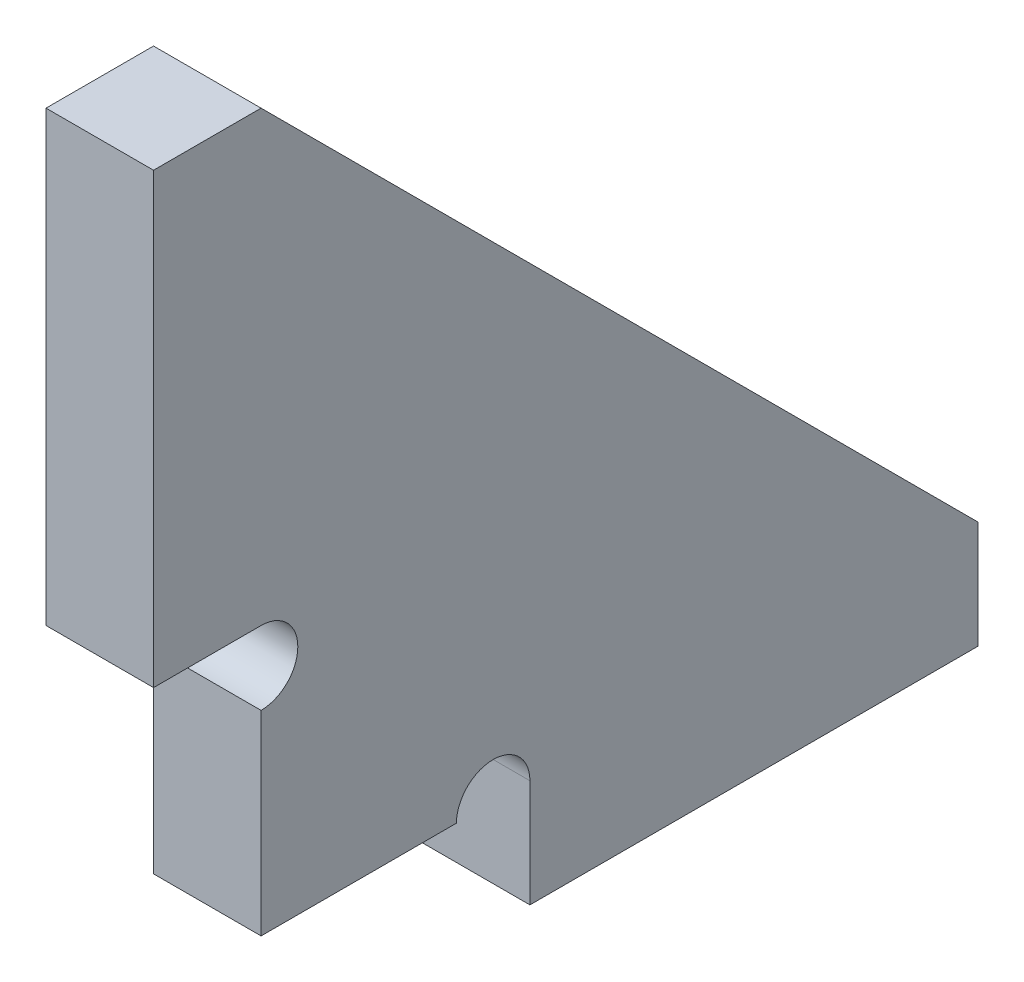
ISO-10303-21;
HEADER;
FILE_DESCRIPTION(('STEP AP214'),'2;1');
FILE_NAME('part.step','',(''),(''),'','','');
FILE_SCHEMA(('AUTOMOTIVE_DESIGN { 1 0 10303 214 1 1 1 1 }'));
ENDSEC;
DATA;
#1=APPLICATION_CONTEXT('core data for automotive mechanical design processes');
#2=APPLICATION_PROTOCOL_DEFINITION('international standard','automotive_design',2000,#1);
#3=PRODUCT_CONTEXT('',#1,'mechanical');
#4=PRODUCT('Part','Part','',(#3));
#5=PRODUCT_RELATED_PRODUCT_CATEGORY('part','',(#4));
#6=PRODUCT_DEFINITION_FORMATION('','',#4);
#7=PRODUCT_DEFINITION_CONTEXT('part definition',#1,'design');
#8=PRODUCT_DEFINITION('design','',#6,#7);
#9=PRODUCT_DEFINITION_SHAPE('','',#8);
#10=(LENGTH_UNIT() NAMED_UNIT(*) SI_UNIT(.MILLI.,.METRE.));
#11=(NAMED_UNIT(*) PLANE_ANGLE_UNIT() SI_UNIT($,.RADIAN.));
#12=(NAMED_UNIT(*) SI_UNIT($,.STERADIAN.) SOLID_ANGLE_UNIT());
#13=UNCERTAINTY_MEASURE_WITH_UNIT(LENGTH_MEASURE(1.E-05),#10,'distance_accuracy_value','');
#14=(GEOMETRIC_REPRESENTATION_CONTEXT(3) GLOBAL_UNCERTAINTY_ASSIGNED_CONTEXT((#13)) GLOBAL_UNIT_ASSIGNED_CONTEXT((#10,
#11,#12)) REPRESENTATION_CONTEXT('',''));
#15=CARTESIAN_POINT('',(0.,0.,0.));
#16=DIRECTION('',(0.,0.,1.));
#17=DIRECTION('',(1.,0.,0.));
#18=AXIS2_PLACEMENT_3D('',#15,#16,#17);
#19=CARTESIAN_POINT('',(12.,12.,0.));
#20=DIRECTION('',(0.,0.,1.));
#21=DIRECTION('',(0.,-1.,0.));
#22=AXIS2_PLACEMENT_3D('',#19,#20,#21);
#23=PLANE('',#22);
#24=DIRECTION('',(0.,1.,0.));
#25=VECTOR('',#24,1.);
#26=CARTESIAN_POINT('',(0.,12.,0.));
#27=LINE('',#26,#25);
#28=CARTESIAN_POINT('',(0.,0.,0.));
#29=VERTEX_POINT('',#28);
#30=CARTESIAN_POINT('',(0.,12.,0.));
#31=VERTEX_POINT('',#30);
#32=EDGE_CURVE('E154',#29,#31,#27,.T.);
#33=ORIENTED_EDGE('',*,*,#32,.T.);
#34=DIRECTION('',(-1.,0.,0.));
#35=VECTOR('',#34,1.);
#36=CARTESIAN_POINT('',(12.,12.,0.));
#37=LINE('',#36,#35);
#38=CARTESIAN_POINT('',(12.,12.,0.));
#39=VERTEX_POINT('',#38);
#40=EDGE_CURVE('E11',#39,#31,#37,.T.);
#41=ORIENTED_EDGE('',*,*,#40,.F.);
#42=DIRECTION('',(0.,1.,0.));
#43=VECTOR('',#42,1.);
#44=CARTESIAN_POINT('',(12.,12.,0.));
#45=LINE('',#44,#43);
#46=CARTESIAN_POINT('',(12.,0.,0.));
#47=VERTEX_POINT('',#46);
#48=EDGE_CURVE('E174',#47,#39,#45,.T.);
#49=ORIENTED_EDGE('',*,*,#48,.F.);
#50=DIRECTION('',(-1.,0.,0.));
#51=VECTOR('',#50,1.);
#52=CARTESIAN_POINT('',(12.,0.,0.));
#53=LINE('',#52,#51);
#54=EDGE_CURVE('E150',#47,#29,#53,.T.);
#55=ORIENTED_EDGE('',*,*,#54,.T.);
#56=EDGE_LOOP('',(#33,#41,#49,#55));
#57=FACE_BOUND('',#56,.T.);
#58=ADVANCED_FACE('F40',(#57),#23,.F.);
#59=CARTESIAN_POINT('',(12.,92.,80.));
#60=DIRECTION('',(0.,-0.707106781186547,0.707106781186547));
#61=DIRECTION('',(0.,-0.707106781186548,-0.707106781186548));
#62=AXIS2_PLACEMENT_3D('',#59,#60,#61);
#63=PLANE('',#62);
#64=DIRECTION('',(0.,0.707106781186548,0.707106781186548));
#65=VECTOR('',#64,1.);
#66=CARTESIAN_POINT('',(0.,92.,80.));
#67=LINE('',#66,#65);
#68=CARTESIAN_POINT('',(0.,92.,80.));
#69=VERTEX_POINT('',#68);
#70=EDGE_CURVE('E157',#31,#69,#67,.T.);
#71=ORIENTED_EDGE('',*,*,#70,.T.);
#72=DIRECTION('',(-1.,0.,0.));
#73=VECTOR('',#72,1.);
#74=CARTESIAN_POINT('',(12.,92.,80.));
#75=LINE('',#74,#73);
#76=CARTESIAN_POINT('',(12.,92.,80.));
#77=VERTEX_POINT('',#76);
#78=EDGE_CURVE('E48',#77,#69,#75,.T.);
#79=ORIENTED_EDGE('',*,*,#78,.F.);
#80=DIRECTION('',(0.,0.707106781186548,0.707106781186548));
#81=VECTOR('',#80,1.);
#82=CARTESIAN_POINT('',(12.,92.,80.));
#83=LINE('',#82,#81);
#84=EDGE_CURVE('E108',#39,#77,#83,.T.);
#85=ORIENTED_EDGE('',*,*,#84,.F.);
#86=ORIENTED_EDGE('',*,*,#40,.T.);
#87=EDGE_LOOP('',(#71,#79,#85,#86));
#88=FACE_BOUND('',#87,.T.);
#89=ADVANCED_FACE('F246',(#88),#63,.F.);
#90=CARTESIAN_POINT('',(12.,92.,92.));
#91=DIRECTION('',(0.,-1.,0.));
#92=DIRECTION('',(0.,0.,-1.));
#93=AXIS2_PLACEMENT_3D('',#90,#91,#92);
#94=PLANE('',#93);
#95=DIRECTION('',(0.,0.,1.));
#96=VECTOR('',#95,1.);
#97=CARTESIAN_POINT('',(0.,92.,92.));
#98=LINE('',#97,#96);
#99=CARTESIAN_POINT('',(0.,92.,92.));
#100=VERTEX_POINT('',#99);
#101=EDGE_CURVE('E159',#69,#100,#98,.T.);
#102=ORIENTED_EDGE('',*,*,#101,.T.);
#103=DIRECTION('',(-1.,0.,0.));
#104=VECTOR('',#103,1.);
#105=CARTESIAN_POINT('',(12.,92.,92.));
#106=LINE('',#105,#104);
#107=CARTESIAN_POINT('',(12.,92.,92.));
#108=VERTEX_POINT('',#107);
#109=EDGE_CURVE('E190',#108,#100,#106,.T.);
#110=ORIENTED_EDGE('',*,*,#109,.F.);
#111=DIRECTION('',(0.,0.,1.));
#112=VECTOR('',#111,1.);
#113=CARTESIAN_POINT('',(12.,92.,92.));
#114=LINE('',#113,#112);
#115=EDGE_CURVE('E198',#77,#108,#114,.T.);
#116=ORIENTED_EDGE('',*,*,#115,.F.);
#117=ORIENTED_EDGE('',*,*,#78,.T.);
#118=EDGE_LOOP('',(#102,#110,#116,#117));
#119=FACE_BOUND('',#118,.T.);
#120=ADVANCED_FACE('F196',(#119),#94,.F.);
#121=CARTESIAN_POINT('',(12.,42.,92.));
#122=DIRECTION('',(0.,0.,-1.));
#123=DIRECTION('',(-1.,0.,0.));
#124=AXIS2_PLACEMENT_3D('',#121,#122,#123);
#125=PLANE('',#124);
#126=DIRECTION('',(0.,-1.,0.));
#127=VECTOR('',#126,1.);
#128=CARTESIAN_POINT('',(0.,42.,92.));
#129=LINE('',#128,#127);
#130=CARTESIAN_POINT('',(0.,42.,92.));
#131=VERTEX_POINT('',#130);
#132=EDGE_CURVE('E161',#100,#131,#129,.T.);
#133=ORIENTED_EDGE('',*,*,#132,.T.);
#134=DIRECTION('',(-1.,0.,0.));
#135=VECTOR('',#134,1.);
#136=CARTESIAN_POINT('',(12.,42.,92.));
#137=LINE('',#136,#135);
#138=CARTESIAN_POINT('',(12.,42.,92.));
#139=VERTEX_POINT('',#138);
#140=EDGE_CURVE('E187',#139,#131,#137,.T.);
#141=ORIENTED_EDGE('',*,*,#140,.F.);
#142=DIRECTION('',(0.,-1.,0.));
#143=VECTOR('',#142,1.);
#144=CARTESIAN_POINT('',(12.,42.,92.));
#145=LINE('',#144,#143);
#146=EDGE_CURVE('E216',#108,#139,#145,.T.);
#147=ORIENTED_EDGE('',*,*,#146,.F.);
#148=ORIENTED_EDGE('',*,*,#109,.T.);
#149=EDGE_LOOP('',(#133,#141,#147,#148));
#150=FACE_BOUND('',#149,.T.);
#151=ADVANCED_FACE('F207',(#150),#125,.F.);
#152=CARTESIAN_POINT('',(12.,42.,80.));
#153=DIRECTION('',(0.,1.,0.));
#154=DIRECTION('',(0.,0.,1.));
#155=AXIS2_PLACEMENT_3D('',#152,#153,#154);
#156=PLANE('',#155);
#157=DIRECTION('',(0.,0.,-1.));
#158=VECTOR('',#157,1.);
#159=CARTESIAN_POINT('',(0.,42.,80.));
#160=LINE('',#159,#158);
#161=CARTESIAN_POINT('',(0.,42.,80.));
#162=VERTEX_POINT('',#161);
#163=EDGE_CURVE('E163',#131,#162,#160,.T.);
#164=ORIENTED_EDGE('',*,*,#163,.T.);
#165=DIRECTION('',(-1.,0.,0.));
#166=VECTOR('',#165,1.);
#167=CARTESIAN_POINT('',(12.,42.,80.));
#168=LINE('',#167,#166);
#169=CARTESIAN_POINT('',(12.,42.,80.));
#170=VERTEX_POINT('',#169);
#171=EDGE_CURVE('E184',#170,#162,#168,.T.);
#172=ORIENTED_EDGE('',*,*,#171,.F.);
#173=DIRECTION('',(0.,0.,-1.));
#174=VECTOR('',#173,1.);
#175=CARTESIAN_POINT('',(12.,42.,80.));
#176=LINE('',#175,#174);
#177=EDGE_CURVE('E213',#139,#170,#176,.T.);
#178=ORIENTED_EDGE('',*,*,#177,.F.);
#179=ORIENTED_EDGE('',*,*,#140,.T.);
#180=EDGE_LOOP('',(#164,#172,#178,#179));
#181=FACE_BOUND('',#180,.T.);
#182=ADVANCED_FACE('F211',(#181),#156,.F.);
#183=CARTESIAN_POINT('',(12.,37.9,80.));
#184=DIRECTION('',(-1.,0.,0.));
#185=DIRECTION('',(0.,0.,1.));
#186=AXIS2_PLACEMENT_3D('',#183,#184,#185);
#187=CYLINDRICAL_SURFACE('',#186,4.1);
#188=CARTESIAN_POINT('',(0.,37.9,80.));
#189=DIRECTION('',(-1.,0.,0.));
#190=DIRECTION('',(0.,0.,1.));
#191=AXIS2_PLACEMENT_3D('',#188,#189,#190);
#192=CIRCLE('',#191,4.1);
#193=CARTESIAN_POINT('',(0.,33.8,80.));
#194=VERTEX_POINT('',#193);
#195=EDGE_CURVE('E165',#162,#194,#192,.T.);
#196=ORIENTED_EDGE('',*,*,#195,.T.);
#197=DIRECTION('',(-1.,0.,0.));
#198=VECTOR('',#197,1.);
#199=CARTESIAN_POINT('',(12.,33.8,80.));
#200=LINE('',#199,#198);
#201=CARTESIAN_POINT('',(12.,33.8,80.));
#202=VERTEX_POINT('',#201);
#203=EDGE_CURVE('E181',#202,#194,#200,.T.);
#204=ORIENTED_EDGE('',*,*,#203,.F.);
#205=CARTESIAN_POINT('',(12.,37.9,80.));
#206=DIRECTION('',(-1.,0.,0.));
#207=DIRECTION('',(0.,0.,1.));
#208=AXIS2_PLACEMENT_3D('',#205,#206,#207);
#209=CIRCLE('',#208,4.1);
#210=EDGE_CURVE('E215',#170,#202,#209,.T.);
#211=ORIENTED_EDGE('',*,*,#210,.F.);
#212=ORIENTED_EDGE('',*,*,#171,.T.);
#213=EDGE_LOOP('',(#196,#204,#211,#212));
#214=FACE_BOUND('',#213,.T.);
#215=ADVANCED_FACE('F259',(#214),#187,.F.);
#216=CARTESIAN_POINT('',(12.,12.,80.));
#217=DIRECTION('',(0.,0.,-1.));
#218=DIRECTION('',(-1.,0.,0.));
#219=AXIS2_PLACEMENT_3D('',#216,#217,#218);
#220=PLANE('',#219);
#221=DIRECTION('',(0.,-1.,0.));
#222=VECTOR('',#221,1.);
#223=CARTESIAN_POINT('',(0.,12.,80.));
#224=LINE('',#223,#222);
#225=CARTESIAN_POINT('',(0.,12.,80.));
#226=VERTEX_POINT('',#225);
#227=EDGE_CURVE('E167',#194,#226,#224,.T.);
#228=ORIENTED_EDGE('',*,*,#227,.T.);
#229=DIRECTION('',(-1.,0.,0.));
#230=VECTOR('',#229,1.);
#231=CARTESIAN_POINT('',(12.,12.,80.));
#232=LINE('',#231,#230);
#233=CARTESIAN_POINT('',(12.,12.,80.));
#234=VERTEX_POINT('',#233);
#235=EDGE_CURVE('E178',#234,#226,#232,.T.);
#236=ORIENTED_EDGE('',*,*,#235,.F.);
#237=DIRECTION('',(0.,-1.,0.));
#238=VECTOR('',#237,1.);
#239=CARTESIAN_POINT('',(12.,12.,80.));
#240=LINE('',#239,#238);
#241=EDGE_CURVE('E218',#202,#234,#240,.T.);
#242=ORIENTED_EDGE('',*,*,#241,.F.);
#243=ORIENTED_EDGE('',*,*,#203,.T.);
#244=EDGE_LOOP('',(#228,#236,#242,#243));
#245=FACE_BOUND('',#244,.T.);
#246=ADVANCED_FACE('F227',(#245),#220,.F.);
#247=CARTESIAN_POINT('',(12.,12.,58.2));
#248=DIRECTION('',(0.,1.,0.));
#249=DIRECTION('',(0.,0.,1.));
#250=AXIS2_PLACEMENT_3D('',#247,#248,#249);
#251=PLANE('',#250);
#252=DIRECTION('',(0.,0.,-1.));
#253=VECTOR('',#252,1.);
#254=CARTESIAN_POINT('',(0.,12.,58.2));
#255=LINE('',#254,#253);
#256=CARTESIAN_POINT('',(0.,12.,58.2));
#257=VERTEX_POINT('',#256);
#258=EDGE_CURVE('E169',#226,#257,#255,.T.);
#259=ORIENTED_EDGE('',*,*,#258,.T.);
#260=DIRECTION('',(-1.,0.,0.));
#261=VECTOR('',#260,1.);
#262=CARTESIAN_POINT('',(12.,12.,58.2));
#263=LINE('',#262,#261);
#264=CARTESIAN_POINT('',(12.,12.,58.2));
#265=VERTEX_POINT('',#264);
#266=EDGE_CURVE('E145',#265,#257,#263,.T.);
#267=ORIENTED_EDGE('',*,*,#266,.F.);
#268=DIRECTION('',(0.,0.,-1.));
#269=VECTOR('',#268,1.);
#270=CARTESIAN_POINT('',(12.,12.,58.2));
#271=LINE('',#270,#269);
#272=EDGE_CURVE('E136',#234,#265,#271,.T.);
#273=ORIENTED_EDGE('',*,*,#272,.F.);
#274=ORIENTED_EDGE('',*,*,#235,.T.);
#275=EDGE_LOOP('',(#259,#267,#273,#274));
#276=FACE_BOUND('',#275,.T.);
#277=ADVANCED_FACE('F231',(#276),#251,.F.);
#278=CARTESIAN_POINT('',(12.,12.,54.1));
#279=DIRECTION('',(-1.,0.,0.));
#280=DIRECTION('',(0.,0.,1.));
#281=AXIS2_PLACEMENT_3D('',#278,#279,#280);
#282=CYLINDRICAL_SURFACE('',#281,4.1);
#283=CARTESIAN_POINT('',(0.,12.,54.1));
#284=DIRECTION('',(-1.,0.,0.));
#285=DIRECTION('',(0.,0.,-1.));
#286=AXIS2_PLACEMENT_3D('',#283,#284,#285);
#287=CIRCLE('',#286,4.1);
#288=CARTESIAN_POINT('',(0.,12.,50.));
#289=VERTEX_POINT('',#288);
#290=EDGE_CURVE('E144',#257,#289,#287,.T.);
#291=ORIENTED_EDGE('',*,*,#290,.T.);
#292=DIRECTION('',(-1.,0.,0.));
#293=VECTOR('',#292,1.);
#294=CARTESIAN_POINT('',(12.,12.,50.));
#295=LINE('',#294,#293);
#296=CARTESIAN_POINT('',(12.,12.,50.));
#297=VERTEX_POINT('',#296);
#298=EDGE_CURVE('E141',#297,#289,#295,.T.);
#299=ORIENTED_EDGE('',*,*,#298,.F.);
#300=CARTESIAN_POINT('',(12.,12.,54.1));
#301=DIRECTION('',(-1.,0.,0.));
#302=DIRECTION('',(0.,0.,-1.));
#303=AXIS2_PLACEMENT_3D('',#300,#301,#302);
#304=CIRCLE('',#303,4.1);
#305=EDGE_CURVE('E130',#265,#297,#304,.T.);
#306=ORIENTED_EDGE('',*,*,#305,.F.);
#307=ORIENTED_EDGE('',*,*,#266,.T.);
#308=EDGE_LOOP('',(#291,#299,#306,#307));
#309=FACE_BOUND('',#308,.T.);
#310=ADVANCED_FACE('F142',(#309),#282,.F.);
#311=CARTESIAN_POINT('',(12.,0.,50.));
#312=DIRECTION('',(0.,0.,-1.));
#313=DIRECTION('',(-1.,0.,0.));
#314=AXIS2_PLACEMENT_3D('',#311,#312,#313);
#315=PLANE('',#314);
#316=DIRECTION('',(0.,-1.,0.));
#317=VECTOR('',#316,1.);
#318=CARTESIAN_POINT('',(0.,0.,50.));
#319=LINE('',#318,#317);
#320=CARTESIAN_POINT('',(0.,0.,50.));
#321=VERTEX_POINT('',#320);
#322=EDGE_CURVE('E94',#289,#321,#319,.T.);
#323=ORIENTED_EDGE('',*,*,#322,.T.);
#324=DIRECTION('',(-1.,0.,0.));
#325=VECTOR('',#324,1.);
#326=CARTESIAN_POINT('',(12.,0.,50.));
#327=LINE('',#326,#325);
#328=CARTESIAN_POINT('',(12.,0.,50.));
#329=VERTEX_POINT('',#328);
#330=EDGE_CURVE('E146',#329,#321,#327,.T.);
#331=ORIENTED_EDGE('',*,*,#330,.F.);
#332=DIRECTION('',(0.,-1.,0.));
#333=VECTOR('',#332,1.);
#334=CARTESIAN_POINT('',(12.,0.,50.));
#335=LINE('',#334,#333);
#336=EDGE_CURVE('E134',#297,#329,#335,.T.);
#337=ORIENTED_EDGE('',*,*,#336,.F.);
#338=ORIENTED_EDGE('',*,*,#298,.T.);
#339=EDGE_LOOP('',(#323,#331,#337,#338));
#340=FACE_BOUND('',#339,.T.);
#341=ADVANCED_FACE('F148',(#340),#315,.F.);
#342=CARTESIAN_POINT('',(12.,0.,0.));
#343=DIRECTION('',(0.,1.,0.));
#344=DIRECTION('',(0.,0.,1.));
#345=AXIS2_PLACEMENT_3D('',#342,#343,#344);
#346=PLANE('',#345);
#347=DIRECTION('',(0.,0.,-1.));
#348=VECTOR('',#347,1.);
#349=CARTESIAN_POINT('',(0.,0.,0.));
#350=LINE('',#349,#348);
#351=EDGE_CURVE('E100',#321,#29,#350,.T.);
#352=ORIENTED_EDGE('',*,*,#351,.T.);
#353=ORIENTED_EDGE('',*,*,#54,.F.);
#354=DIRECTION('',(0.,0.,-1.));
#355=VECTOR('',#354,1.);
#356=CARTESIAN_POINT('',(12.,0.,0.));
#357=LINE('',#356,#355);
#358=EDGE_CURVE('E56',#329,#47,#357,.T.);
#359=ORIENTED_EDGE('',*,*,#358,.F.);
#360=ORIENTED_EDGE('',*,*,#330,.T.);
#361=EDGE_LOOP('',(#352,#353,#359,#360));
#362=FACE_BOUND('',#361,.T.);
#363=ADVANCED_FACE('F235',(#362),#346,.F.);
#364=CARTESIAN_POINT('',(12.,12.,54.1));
#365=DIRECTION('',(1.,0.,0.));
#366=DIRECTION('',(0.,0.,-1.));
#367=AXIS2_PLACEMENT_3D('',#364,#365,#366);
#368=PLANE('',#367);
#369=ORIENTED_EDGE('',*,*,#48,.T.);
#370=ORIENTED_EDGE('',*,*,#84,.T.);
#371=ORIENTED_EDGE('',*,*,#115,.T.);
#372=ORIENTED_EDGE('',*,*,#146,.T.);
#373=ORIENTED_EDGE('',*,*,#177,.T.);
#374=ORIENTED_EDGE('',*,*,#210,.T.);
#375=ORIENTED_EDGE('',*,*,#241,.T.);
#376=ORIENTED_EDGE('',*,*,#272,.T.);
#377=ORIENTED_EDGE('',*,*,#305,.T.);
#378=ORIENTED_EDGE('',*,*,#336,.T.);
#379=ORIENTED_EDGE('',*,*,#358,.T.);
#380=EDGE_LOOP('',(#369,#370,#371,#372,#373,#374,#375,#376,#377,#378,#379));
#381=FACE_BOUND('',#380,.T.);
#382=ADVANCED_FACE('F132',(#381),#368,.T.);
#383=CARTESIAN_POINT('',(0.,12.,54.1));
#384=DIRECTION('',(1.,0.,0.));
#385=DIRECTION('',(0.,0.,-1.));
#386=AXIS2_PLACEMENT_3D('',#383,#384,#385);
#387=PLANE('',#386);
#388=ORIENTED_EDGE('',*,*,#32,.F.);
#389=ORIENTED_EDGE('',*,*,#351,.F.);
#390=ORIENTED_EDGE('',*,*,#322,.F.);
#391=ORIENTED_EDGE('',*,*,#290,.F.);
#392=ORIENTED_EDGE('',*,*,#258,.F.);
#393=ORIENTED_EDGE('',*,*,#227,.F.);
#394=ORIENTED_EDGE('',*,*,#195,.F.);
#395=ORIENTED_EDGE('',*,*,#163,.F.);
#396=ORIENTED_EDGE('',*,*,#132,.F.);
#397=ORIENTED_EDGE('',*,*,#101,.F.);
#398=ORIENTED_EDGE('',*,*,#70,.F.);
#399=EDGE_LOOP('',(#388,#389,#390,#391,#392,#393,#394,#395,#396,#397,#398));
#400=FACE_BOUND('',#399,.T.);
#401=ADVANCED_FACE('F202',(#400),#387,.F.);
#402=CLOSED_SHELL('',(#58,#89,#120,#151,#182,#215,#246,#277,#310,#341,#363,#382,#401));
#403=MANIFOLD_SOLID_BREP('B2',#402);
#404=ADVANCED_BREP_SHAPE_REPRESENTATION('',(#18,#403),#14);
#405=SHAPE_DEFINITION_REPRESENTATION(#9,#404);
ENDSEC;
END-ISO-10303-21;
